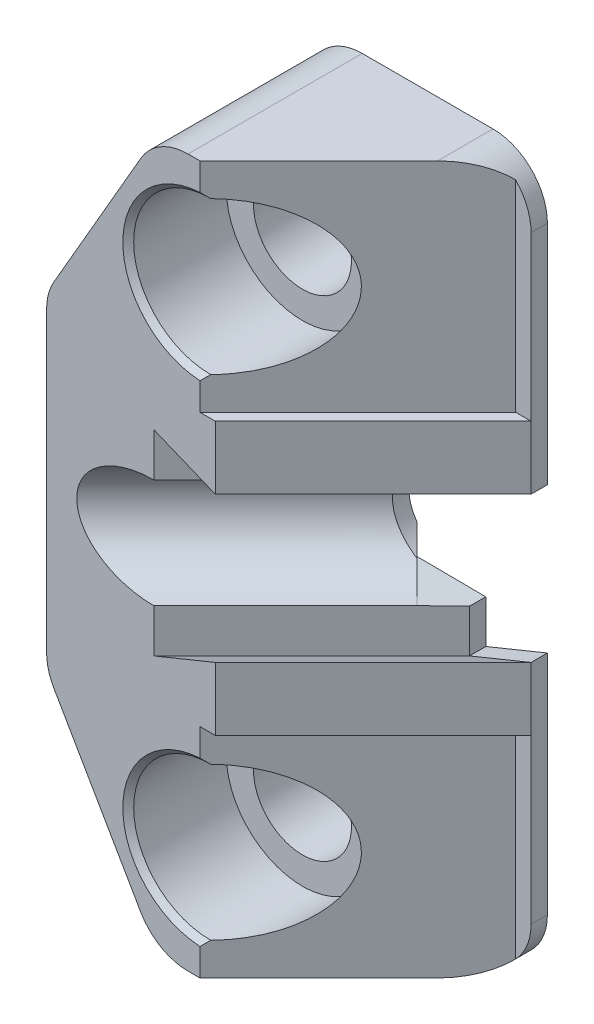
ISO-10303-21;
HEADER;
FILE_DESCRIPTION(('STEP AP214'),'2;1');
FILE_NAME('part.step','',(''),(''),'','','');
FILE_SCHEMA(('AUTOMOTIVE_DESIGN { 1 0 10303 214 1 1 1 1 }'));
ENDSEC;
DATA;
#1=APPLICATION_CONTEXT('core data for automotive mechanical design processes');
#2=APPLICATION_PROTOCOL_DEFINITION('international standard','automotive_design',2000,#1);
#3=PRODUCT_CONTEXT('',#1,'mechanical');
#4=PRODUCT('Part','Part','',(#3));
#5=PRODUCT_RELATED_PRODUCT_CATEGORY('part','',(#4));
#6=PRODUCT_DEFINITION_FORMATION('','',#4);
#7=PRODUCT_DEFINITION_CONTEXT('part definition',#1,'design');
#8=PRODUCT_DEFINITION('design','',#6,#7);
#9=PRODUCT_DEFINITION_SHAPE('','',#8);
#10=(LENGTH_UNIT() NAMED_UNIT(*) SI_UNIT(.MILLI.,.METRE.));
#11=(NAMED_UNIT(*) PLANE_ANGLE_UNIT() SI_UNIT($,.RADIAN.));
#12=(NAMED_UNIT(*) SI_UNIT($,.STERADIAN.) SOLID_ANGLE_UNIT());
#13=UNCERTAINTY_MEASURE_WITH_UNIT(LENGTH_MEASURE(1.E-05),#10,'distance_accuracy_value','');
#14=(GEOMETRIC_REPRESENTATION_CONTEXT(3) GLOBAL_UNCERTAINTY_ASSIGNED_CONTEXT((#13)) GLOBAL_UNIT_ASSIGNED_CONTEXT((#10,
#11,#12)) REPRESENTATION_CONTEXT('',''));
#15=CARTESIAN_POINT('',(0.,0.,0.));
#16=DIRECTION('',(0.,0.,1.));
#17=DIRECTION('',(1.,0.,0.));
#18=AXIS2_PLACEMENT_3D('',#15,#16,#17);
#19=CARTESIAN_POINT('',(15.5,-10.,16.));
#20=DIRECTION('',(0.,1.,0.));
#21=DIRECTION('',(0.,0.,-1.));
#22=AXIS2_PLACEMENT_3D('',#19,#20,#21);
#23=PLANE('',#22);
#24=DIRECTION('',(-1.,0.,0.));
#25=VECTOR('',#24,1.);
#26=CARTESIAN_POINT('',(-22.5,-10.,0.));
#27=LINE('',#26,#25);
#28=CARTESIAN_POINT('',(10.5,-10.,0.));
#29=VERTEX_POINT('',#28);
#30=CARTESIAN_POINT('',(-1.50961894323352,-10.,0.));
#31=VERTEX_POINT('',#30);
#32=EDGE_CURVE('E705',#29,#31,#27,.T.);
#33=ORIENTED_EDGE('',*,*,#32,.F.);
#34=DIRECTION('',(0.,0.,1.));
#35=VECTOR('',#34,1.);
#36=CARTESIAN_POINT('',(10.5,-10.,16.));
#37=LINE('',#36,#35);
#38=CARTESIAN_POINT('',(10.5,-10.,5.08578643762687));
#39=VERTEX_POINT('',#38);
#40=EDGE_CURVE('E422',#29,#39,#37,.T.);
#41=ORIENTED_EDGE('',*,*,#40,.T.);
#42=DIRECTION('',(-0.707106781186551,0.,0.707106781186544));
#43=VECTOR('',#42,1.);
#44=CARTESIAN_POINT('',(14.0857864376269,-10.,1.5));
#45=LINE('',#44,#43);
#46=CARTESIAN_POINT('',(-0.414213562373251,-10.,16.));
#47=VERTEX_POINT('',#46);
#48=EDGE_CURVE('E265',#39,#47,#45,.T.);
#49=ORIENTED_EDGE('',*,*,#48,.T.);
#50=DIRECTION('',(1.,0.,0.));
#51=VECTOR('',#50,1.);
#52=CARTESIAN_POINT('',(15.5,-10.,16.));
#53=LINE('',#52,#51);
#54=CARTESIAN_POINT('',(-1.50961894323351,-10.,16.));
#55=VERTEX_POINT('',#54);
#56=EDGE_CURVE('E600',#55,#47,#53,.T.);
#57=ORIENTED_EDGE('',*,*,#56,.F.);
#58=DIRECTION('',(0.,0.,1.));
#59=VECTOR('',#58,1.);
#60=CARTESIAN_POINT('',(-1.50961894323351,-10.,16.));
#61=LINE('',#60,#59);
#62=EDGE_CURVE('E635',#55,#31,#61,.F.);
#63=ORIENTED_EDGE('',*,*,#62,.T.);
#64=EDGE_LOOP('',(#33,#41,#49,#57,#63));
#65=FACE_BOUND('',#64,.T.);
#66=ADVANCED_FACE('F14',(#65),#23,.F.);
#67=CARTESIAN_POINT('',(15.5,55.,16.));
#68=DIRECTION('',(0.,0.,1.));
#69=DIRECTION('',(-1.,0.,0.));
#70=AXIS2_PLACEMENT_3D('',#67,#68,#69);
#71=PLANE('',#70);
#72=ORIENTED_EDGE('',*,*,#56,.T.);
#73=DIRECTION('',(0.,-1.,0.));
#74=VECTOR('',#73,1.);
#75=CARTESIAN_POINT('',(-0.414213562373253,10.,16.));
#76=LINE('',#75,#74);
#77=CARTESIAN_POINT('',(-0.414213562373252,-7.4885530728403,16.));
#78=VERTEX_POINT('',#77);
#79=EDGE_CURVE('E283',#78,#47,#76,.T.);
#80=ORIENTED_EDGE('',*,*,#79,.F.);
#81=CARTESIAN_POINT('',(0.,0.,16.));
#82=DIRECTION('',(0.,0.,1.));
#83=DIRECTION('',(-1.,0.,0.));
#84=AXIS2_PLACEMENT_3D('',#81,#82,#83);
#85=CIRCLE('',#84,7.5);
#86=CARTESIAN_POINT('',(-0.414213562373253,7.4885530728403,16.));
#87=VERTEX_POINT('',#86);
#88=EDGE_CURVE('E616',#78,#87,#85,.F.);
#89=ORIENTED_EDGE('',*,*,#88,.T.);
#90=CARTESIAN_POINT('',(-0.414213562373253,10.,16.));
#91=VERTEX_POINT('',#90);
#92=EDGE_CURVE('E288',#91,#87,#76,.T.);
#93=ORIENTED_EDGE('',*,*,#92,.F.);
#94=DIRECTION('',(1.,0.,0.));
#95=VECTOR('',#94,1.);
#96=CARTESIAN_POINT('',(0.999999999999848,10.,16.));
#97=LINE('',#96,#95);
#98=CARTESIAN_POINT('',(0.999999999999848,10.,16.));
#99=VERTEX_POINT('',#98);
#100=EDGE_CURVE('E278',#91,#99,#97,.T.);
#101=ORIENTED_EDGE('',*,*,#100,.T.);
#102=DIRECTION('',(0.,1.,0.));
#103=VECTOR('',#102,1.);
#104=CARTESIAN_POINT('',(0.99999999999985,-10.,16.));
#105=LINE('',#104,#103);
#106=CARTESIAN_POINT('',(0.999999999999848,15.8094010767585,16.));
#107=VERTEX_POINT('',#106);
#108=EDGE_CURVE('E592',#99,#107,#105,.T.);
#109=ORIENTED_EDGE('',*,*,#108,.T.);
#110=DIRECTION('',(0.925820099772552,0.377964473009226,0.));
#111=VECTOR('',#110,1.);
#112=CARTESIAN_POINT('',(27.1424242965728,26.4820011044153,16.));
#113=LINE('',#112,#111);
#114=CARTESIAN_POINT('',(-4.65685424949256,13.5,16.));
#115=VERTEX_POINT('',#114);
#116=EDGE_CURVE('E540',#115,#107,#113,.T.);
#117=ORIENTED_EDGE('',*,*,#116,.F.);
#118=DIRECTION('',(0.,-1.,0.));
#119=VECTOR('',#118,1.);
#120=CARTESIAN_POINT('',(-4.65685424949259,55.,16.));
#121=LINE('',#120,#119);
#122=CARTESIAN_POINT('',(-4.65685424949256,17.5,16.));
#123=VERTEX_POINT('',#122);
#124=EDGE_CURVE('E575',#123,#115,#121,.T.);
#125=ORIENTED_EDGE('',*,*,#124,.F.);
#126=CARTESIAN_POINT('',(-4.65685424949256,22.5,16.));
#127=DIRECTION('',(0.,0.,1.));
#128=DIRECTION('',(-1.,0.,0.));
#129=AXIS2_PLACEMENT_3D('',#126,#127,#128);
#130=ELLIPSE('',#129,7.07106781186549,5.);
#131=CARTESIAN_POINT('',(-4.65685424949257,27.5,16.));
#132=VERTEX_POINT('',#131);
#133=EDGE_CURVE('E556',#132,#123,#130,.T.);
#134=ORIENTED_EDGE('',*,*,#133,.F.);
#135=CARTESIAN_POINT('',(-4.65685424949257,31.5,16.));
#136=VERTEX_POINT('',#135);
#137=EDGE_CURVE('E576',#136,#132,#121,.T.);
#138=ORIENTED_EDGE('',*,*,#137,.F.);
#139=DIRECTION('',(-0.925820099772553,0.377964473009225,0.));
#140=VECTOR('',#139,1.);
#141=CARTESIAN_POINT('',(4.39716239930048,27.8037131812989,16.));
#142=LINE('',#141,#140);
#143=CARTESIAN_POINT('',(0.999999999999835,29.1905989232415,16.));
#144=VERTEX_POINT('',#143);
#145=EDGE_CURVE('E539',#144,#136,#142,.T.);
#146=ORIENTED_EDGE('',*,*,#145,.F.);
#147=CARTESIAN_POINT('',(0.999999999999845,35.,16.));
#148=VERTEX_POINT('',#147);
#149=EDGE_CURVE('E591',#144,#148,#105,.T.);
#150=ORIENTED_EDGE('',*,*,#149,.T.);
#151=DIRECTION('',(1.,0.,0.));
#152=VECTOR('',#151,1.);
#153=CARTESIAN_POINT('',(0.999999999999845,35.,16.));
#154=LINE('',#153,#152);
#155=CARTESIAN_POINT('',(-0.414213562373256,35.,16.));
#156=VERTEX_POINT('',#155);
#157=EDGE_CURVE('E299',#156,#148,#154,.T.);
#158=ORIENTED_EDGE('',*,*,#157,.F.);
#159=DIRECTION('',(0.,1.,0.));
#160=VECTOR('',#159,1.);
#161=CARTESIAN_POINT('',(-0.414213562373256,35.,16.));
#162=LINE('',#161,#160);
#163=CARTESIAN_POINT('',(-0.414213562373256,37.5114469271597,16.));
#164=VERTEX_POINT('',#163);
#165=EDGE_CURVE('E309',#156,#164,#162,.T.);
#166=ORIENTED_EDGE('',*,*,#165,.T.);
#167=CARTESIAN_POINT('',(0.,45.,16.));
#168=DIRECTION('',(0.,0.,1.));
#169=DIRECTION('',(-1.,0.,0.));
#170=AXIS2_PLACEMENT_3D('',#167,#168,#169);
#171=CIRCLE('',#170,7.5);
#172=CARTESIAN_POINT('',(-0.414213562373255,52.4885530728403,16.));
#173=VERTEX_POINT('',#172);
#174=EDGE_CURVE('E613',#164,#173,#171,.F.);
#175=ORIENTED_EDGE('',*,*,#174,.T.);
#176=CARTESIAN_POINT('',(-0.414213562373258,55.,16.));
#177=VERTEX_POINT('',#176);
#178=EDGE_CURVE('E312',#173,#177,#162,.T.);
#179=ORIENTED_EDGE('',*,*,#178,.T.);
#180=DIRECTION('',(-1.,0.,0.));
#181=VECTOR('',#180,1.);
#182=CARTESIAN_POINT('',(15.5,55.,16.));
#183=LINE('',#182,#181);
#184=CARTESIAN_POINT('',(-1.50961894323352,55.,16.));
#185=VERTEX_POINT('',#184);
#186=EDGE_CURVE('E597',#177,#185,#183,.T.);
#187=ORIENTED_EDGE('',*,*,#186,.T.);
#188=CARTESIAN_POINT('',(-1.50961894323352,50.,16.));
#189=DIRECTION('',(0.,0.,1.));
#190=DIRECTION('',(-1.,0.,0.));
#191=AXIS2_PLACEMENT_3D('',#188,#189,#190);
#192=CIRCLE('',#191,5.);
#193=CARTESIAN_POINT('',(-5.83974596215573,52.5,16.));
#194=VERTEX_POINT('',#193);
#195=EDGE_CURVE('E629',#185,#194,#192,.T.);
#196=ORIENTED_EDGE('',*,*,#195,.T.);
#197=DIRECTION('',(0.5,0.866025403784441,0.));
#198=VECTOR('',#197,1.);
#199=CARTESIAN_POINT('',(-14.5,37.5,16.));
#200=LINE('',#199,#198);
#201=CARTESIAN_POINT('',(-13.8301270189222,38.6602540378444,16.));
#202=VERTEX_POINT('',#201);
#203=EDGE_CURVE('E317',#202,#194,#200,.T.);
#204=ORIENTED_EDGE('',*,*,#203,.F.);
#205=CARTESIAN_POINT('',(-9.5,36.1602540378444,16.));
#206=DIRECTION('',(0.,0.,1.));
#207=DIRECTION('',(-1.,0.,0.));
#208=AXIS2_PLACEMENT_3D('',#205,#206,#207);
#209=CIRCLE('',#208,5.);
#210=CARTESIAN_POINT('',(-14.5,36.1602540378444,16.));
#211=VERTEX_POINT('',#210);
#212=EDGE_CURVE('E627',#202,#211,#209,.T.);
#213=ORIENTED_EDGE('',*,*,#212,.T.);
#214=DIRECTION('',(0.,1.,0.));
#215=VECTOR('',#214,1.);
#216=CARTESIAN_POINT('',(-14.5,-10.,16.));
#217=LINE('',#216,#215);
#218=CARTESIAN_POINT('',(-14.5,8.8397459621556,16.));
#219=VERTEX_POINT('',#218);
#220=EDGE_CURVE('E329',#219,#211,#217,.T.);
#221=ORIENTED_EDGE('',*,*,#220,.F.);
#222=CARTESIAN_POINT('',(-9.5,8.8397459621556,16.));
#223=DIRECTION('',(0.,0.,1.));
#224=DIRECTION('',(-1.,0.,0.));
#225=AXIS2_PLACEMENT_3D('',#222,#223,#224);
#226=CIRCLE('',#225,5.);
#227=CARTESIAN_POINT('',(-13.8301270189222,6.33974596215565,16.));
#228=VERTEX_POINT('',#227);
#229=EDGE_CURVE('E631',#219,#228,#226,.T.);
#230=ORIENTED_EDGE('',*,*,#229,.T.);
#231=DIRECTION('',(-0.5,0.866025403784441,0.));
#232=VECTOR('',#231,1.);
#233=CARTESIAN_POINT('',(-14.5,7.5,16.));
#234=LINE('',#233,#232);
#235=CARTESIAN_POINT('',(-5.83974596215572,-7.5,16.));
#236=VERTEX_POINT('',#235);
#237=EDGE_CURVE('E323',#236,#228,#234,.T.);
#238=ORIENTED_EDGE('',*,*,#237,.F.);
#239=CARTESIAN_POINT('',(-1.50961894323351,-5.,16.));
#240=DIRECTION('',(0.,0.,1.));
#241=DIRECTION('',(-1.,0.,0.));
#242=AXIS2_PLACEMENT_3D('',#239,#240,#241);
#243=CIRCLE('',#242,5.);
#244=EDGE_CURVE('E633',#236,#55,#243,.T.);
#245=ORIENTED_EDGE('',*,*,#244,.T.);
#246=EDGE_LOOP('',(#72,#80,#89,#93,#101,#109,#117,#125,#134,#138,#146,#150,#158,#166,#175,#179,
#187,#196,#204,#213,#221,#230,#238,#245));
#247=FACE_BOUND('',#246,.T.);
#248=ADVANCED_FACE('F466',(#247),#71,.T.);
#249=CARTESIAN_POINT('',(15.5,-10.,1.5));
#250=DIRECTION('',(-0.707106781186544,0.,-0.707106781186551));
#251=DIRECTION('',(0.707106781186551,0.,-0.707106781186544));
#252=AXIS2_PLACEMENT_3D('',#249,#250,#251);
#253=PLANE('',#252);
#254=DIRECTION('',(0.707106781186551,0.,-0.707106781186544));
#255=VECTOR('',#254,1.);
#256=CARTESIAN_POINT('',(15.5,10.,1.5));
#257=LINE('',#256,#255);
#258=CARTESIAN_POINT('',(15.5,10.,1.5));
#259=VERTEX_POINT('',#258);
#260=EDGE_CURVE('E275',#99,#259,#257,.T.);
#261=ORIENTED_EDGE('',*,*,#260,.T.);
#262=DIRECTION('',(0.,1.,0.));
#263=VECTOR('',#262,1.);
#264=CARTESIAN_POINT('',(15.5,-10.,1.5));
#265=LINE('',#264,#263);
#266=CARTESIAN_POINT('',(15.5,15.8094010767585,1.49999999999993));
#267=VERTEX_POINT('',#266);
#268=EDGE_CURVE('E598',#259,#267,#265,.T.);
#269=ORIENTED_EDGE('',*,*,#268,.T.);
#270=DIRECTION('',(-0.707106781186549,0.,0.707106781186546));
#271=VECTOR('',#270,1.);
#272=CARTESIAN_POINT('',(15.5,15.8094010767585,1.49999999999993));
#273=LINE('',#272,#271);
#274=EDGE_CURVE('E563',#267,#107,#273,.T.);
#275=ORIENTED_EDGE('',*,*,#274,.T.);
#276=ORIENTED_EDGE('',*,*,#108,.F.);
#277=EDGE_LOOP('',(#261,#269,#275,#276));
#278=FACE_BOUND('',#277,.T.);
#279=ADVANCED_FACE('F472',(#278),#253,.F.);
#280=CARTESIAN_POINT('',(0.,0.,16.));
#281=DIRECTION('',(0.,0.,1.));
#282=DIRECTION('',(-1.,0.,0.));
#283=AXIS2_PLACEMENT_3D('',#280,#281,#282);
#284=CYLINDRICAL_SURFACE('',#283,7.);
#285=CARTESIAN_POINT('',(0.,0.,7.));
#286=DIRECTION('',(0.,0.,1.));
#287=DIRECTION('',(-1.,0.,0.));
#288=AXIS2_PLACEMENT_3D('',#285,#286,#287);
#289=CIRCLE('',#288,7.);
#290=CARTESIAN_POINT('',(-7.,0.,7.));
#291=VERTEX_POINT('',#290);
#292=EDGE_CURVE('E579',#291,#291,#289,.T.);
#293=ORIENTED_EDGE('',*,*,#292,.F.);
#294=EDGE_LOOP('',(#293));
#295=FACE_BOUND('',#294,.T.);
#296=CARTESIAN_POINT('',(0.,0.,15.5857864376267));
#297=DIRECTION('',(0.707106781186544,0.,0.707106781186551));
#298=DIRECTION('',(-0.707106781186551,0.,0.707106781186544));
#299=AXIS2_PLACEMENT_3D('',#296,#297,#298);
#300=ELLIPSE('',#299,9.89949493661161,7.);
#301=CARTESIAN_POINT('',(0.0857864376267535,6.99947431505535,15.5));
#302=VERTEX_POINT('',#301);
#303=CARTESIAN_POINT('',(0.0857864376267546,-6.99947431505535,15.5));
#304=VERTEX_POINT('',#303);
#305=EDGE_CURVE('E287',#302,#304,#300,.F.);
#306=ORIENTED_EDGE('',*,*,#305,.F.);
#307=CARTESIAN_POINT('',(0.,0.,15.5));
#308=DIRECTION('',(0.,0.,1.));
#309=DIRECTION('',(-1.,0.,0.));
#310=AXIS2_PLACEMENT_3D('',#307,#308,#309);
#311=CIRCLE('',#310,7.);
#312=EDGE_CURVE('E610',#302,#304,#311,.T.);
#313=ORIENTED_EDGE('',*,*,#312,.T.);
#314=EDGE_LOOP('',(#306,#313));
#315=FACE_BOUND('',#314,.T.);
#316=ADVANCED_FACE('F430',(#295,#315),#284,.F.);
#317=CARTESIAN_POINT('',(0.,0.,15.5));
#318=DIRECTION('',(0.,0.,1.));
#319=DIRECTION('',(-1.,0.,0.));
#320=AXIS2_PLACEMENT_3D('',#317,#318,#319);
#321=CONICAL_SURFACE('',#320,7.,0.78539816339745);
#322=ORIENTED_EDGE('',*,*,#312,.F.);
#323=CARTESIAN_POINT('',(0.0859864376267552,6.99927184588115,15.4998));
#324=CARTESIAN_POINT('',(0.0447551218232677,7.04101258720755,15.5410313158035));
#325=CARTESIAN_POINT('',(0.00339908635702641,7.08250663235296,15.5823873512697));
#326=CARTESIAN_POINT('',(-0.0795489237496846,7.16501257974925,15.6653353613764));
#327=CARTESIAN_POINT('',(-0.121140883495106,7.20602451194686,15.7069273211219));
#328=CARTESIAN_POINT('',(-0.204552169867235,7.28758247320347,15.790338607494));
#329=CARTESIAN_POINT('',(-0.246371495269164,7.32812850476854,15.8321579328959));
#330=CARTESIAN_POINT('',(-0.330230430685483,7.40877042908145,15.9160168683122));
#331=CARTESIAN_POINT('',(-0.372270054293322,7.44886629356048,15.9580564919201));
#332=CARTESIAN_POINT('',(-0.414413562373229,7.4887423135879,16.0002));
#333=B_SPLINE_CURVE_WITH_KNOTS('',3,(#323,#324,#325,#326,#327,#328,#329,#330,#331,#332),
.UNSPECIFIED.,.F.,.F.,(4,2,2,2,4),(0.,0.215129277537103,0.430245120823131,0.645359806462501,
0.86048792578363),.UNSPECIFIED.);
#334=EDGE_CURVE('E415',#302,#87,#333,.T.);
#335=ORIENTED_EDGE('',*,*,#334,.T.);
#336=ORIENTED_EDGE('',*,*,#88,.F.);
#337=CARTESIAN_POINT('',(-0.414413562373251,-7.48874231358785,16.0002));
#338=CARTESIAN_POINT('',(-0.372270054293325,-7.44886629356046,15.9580564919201));
#339=CARTESIAN_POINT('',(-0.330230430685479,-7.40877042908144,15.9160168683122));
#340=CARTESIAN_POINT('',(-0.246371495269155,-7.32812850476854,15.8321579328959));
#341=CARTESIAN_POINT('',(-0.20455216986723,-7.28758247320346,15.790338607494));
#342=CARTESIAN_POINT('',(-0.121140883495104,-7.20602451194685,15.7069273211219));
#343=CARTESIAN_POINT('',(-0.0795489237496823,-7.16501257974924,15.6653353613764));
#344=CARTESIAN_POINT('',(0.00339908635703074,-7.08250663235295,15.5823873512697));
#345=CARTESIAN_POINT('',(0.0447551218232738,-7.04101258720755,15.5410313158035));
#346=CARTESIAN_POINT('',(0.0859864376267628,-6.99927184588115,15.4998));
#347=B_SPLINE_CURVE_WITH_KNOTS('',3,(#337,#338,#339,#340,#341,#342,#343,#344,#345,#346),
.UNSPECIFIED.,.F.,.F.,(4,2,2,2,4),(0.,0.215128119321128,0.430242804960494,0.645358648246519,
0.86048792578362),.UNSPECIFIED.);
#348=EDGE_CURVE('E407',#78,#304,#347,.T.);
#349=ORIENTED_EDGE('',*,*,#348,.T.);
#350=EDGE_LOOP('',(#322,#335,#336,#349));
#351=FACE_BOUND('',#350,.T.);
#352=ADVANCED_FACE('F424',(#351),#321,.F.);
#353=DIRECTION('',(0.707106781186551,0.,-0.707106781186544));
#354=VECTOR('',#353,1.);
#355=CARTESIAN_POINT('',(15.5,35.,1.5));
#356=LINE('',#355,#354);
#357=CARTESIAN_POINT('',(15.5,35.,1.5));
#358=VERTEX_POINT('',#357);
#359=EDGE_CURVE('E301',#148,#358,#356,.T.);
#360=ORIENTED_EDGE('',*,*,#359,.F.);
#361=ORIENTED_EDGE('',*,*,#149,.F.);
#362=DIRECTION('',(-0.707106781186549,0.,0.707106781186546));
#363=VECTOR('',#362,1.);
#364=CARTESIAN_POINT('',(15.5,29.1905989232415,1.49999999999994));
#365=LINE('',#364,#363);
#366=CARTESIAN_POINT('',(15.5,29.1905989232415,1.49999999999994));
#367=VERTEX_POINT('',#366);
#368=EDGE_CURVE('E560',#367,#144,#365,.T.);
#369=ORIENTED_EDGE('',*,*,#368,.F.);
#370=EDGE_CURVE('E594',#367,#358,#265,.T.);
#371=ORIENTED_EDGE('',*,*,#370,.T.);
#372=EDGE_LOOP('',(#360,#361,#369,#371));
#373=FACE_BOUND('',#372,.T.);
#374=ADVANCED_FACE('F429',(#373),#253,.F.);
#375=CARTESIAN_POINT('',(12.6715728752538,13.5,-1.32842712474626));
#376=DIRECTION('',(-0.707106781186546,0.,-0.707106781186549));
#377=DIRECTION('',(0.707106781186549,0.,-0.707106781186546));
#378=AXIS2_PLACEMENT_3D('',#375,#376,#377);
#379=PLANE('',#378);
#380=DIRECTION('',(0.,-1.,0.));
#381=VECTOR('',#380,1.);
#382=CARTESIAN_POINT('',(9.84314575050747,55.,1.5));
#383=LINE('',#382,#381);
#384=CARTESIAN_POINT('',(9.8431457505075,17.4604018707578,1.5));
#385=VERTEX_POINT('',#384);
#386=CARTESIAN_POINT('',(9.8431457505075,13.5,1.5));
#387=VERTEX_POINT('',#386);
#388=EDGE_CURVE('E603',#385,#387,#383,.T.);
#389=ORIENTED_EDGE('',*,*,#388,.F.);
#390=DIRECTION('',(-0.707059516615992,0.0115620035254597,0.70705951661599));
#391=VECTOR('',#390,1.);
#392=CARTESIAN_POINT('',(12.7035711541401,17.4136275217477,-1.36042540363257));
#393=LINE('',#392,#391);
#394=CARTESIAN_POINT('',(7.42157287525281,17.5,3.92157287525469));
#395=VERTEX_POINT('',#394);
#396=EDGE_CURVE('E37',#385,#395,#393,.T.);
#397=ORIENTED_EDGE('',*,*,#396,.T.);
#398=DIRECTION('',(-0.707106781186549,0.,0.707106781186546));
#399=VECTOR('',#398,1.);
#400=CARTESIAN_POINT('',(12.6715728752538,17.5,-1.3284271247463));
#401=LINE('',#400,#399);
#402=EDGE_CURVE('E608',#395,#123,#401,.T.);
#403=ORIENTED_EDGE('',*,*,#402,.T.);
#404=ORIENTED_EDGE('',*,*,#124,.T.);
#405=DIRECTION('',(-0.707106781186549,0.,0.707106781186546));
#406=VECTOR('',#405,1.);
#407=CARTESIAN_POINT('',(12.6715728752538,13.5,-1.32842712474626));
#408=LINE('',#407,#406);
#409=EDGE_CURVE('E566',#387,#115,#408,.T.);
#410=ORIENTED_EDGE('',*,*,#409,.F.);
#411=EDGE_LOOP('',(#389,#397,#403,#404,#410));
#412=FACE_BOUND('',#411,.T.);
#413=ADVANCED_FACE('F512',(#412),#379,.F.);
#414=CARTESIAN_POINT('',(15.5,55.,16.));
#415=DIRECTION('',(0.,-1.,0.));
#416=DIRECTION('',(0.,0.,1.));
#417=AXIS2_PLACEMENT_3D('',#414,#415,#416);
#418=PLANE('',#417);
#419=DIRECTION('',(-0.707106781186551,0.,0.707106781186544));
#420=VECTOR('',#419,1.);
#421=CARTESIAN_POINT('',(14.0857864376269,55.,1.5));
#422=LINE('',#421,#420);
#423=CARTESIAN_POINT('',(10.5,55.,5.08578643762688));
#424=VERTEX_POINT('',#423);
#425=EDGE_CURVE('E291',#424,#177,#422,.T.);
#426=ORIENTED_EDGE('',*,*,#425,.F.);
#427=DIRECTION('',(0.,0.,1.));
#428=VECTOR('',#427,1.);
#429=CARTESIAN_POINT('',(10.5,55.,16.));
#430=LINE('',#429,#428);
#431=CARTESIAN_POINT('',(10.5,55.,0.));
#432=VERTEX_POINT('',#431);
#433=EDGE_CURVE('E726',#424,#432,#430,.F.);
#434=ORIENTED_EDGE('',*,*,#433,.T.);
#435=DIRECTION('',(1.,0.,0.));
#436=VECTOR('',#435,1.);
#437=CARTESIAN_POINT('',(15.5,55.,0.));
#438=LINE('',#437,#436);
#439=CARTESIAN_POINT('',(-1.50961894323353,55.,0.));
#440=VERTEX_POINT('',#439);
#441=EDGE_CURVE('E341',#440,#432,#438,.T.);
#442=ORIENTED_EDGE('',*,*,#441,.F.);
#443=DIRECTION('',(0.,0.,1.));
#444=VECTOR('',#443,1.);
#445=CARTESIAN_POINT('',(-1.50961894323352,55.,16.));
#446=LINE('',#445,#444);
#447=EDGE_CURVE('E651',#440,#185,#446,.T.);
#448=ORIENTED_EDGE('',*,*,#447,.T.);
#449=ORIENTED_EDGE('',*,*,#186,.F.);
#450=EDGE_LOOP('',(#426,#434,#442,#448,#449));
#451=FACE_BOUND('',#450,.T.);
#452=ADVANCED_FACE('F16',(#451),#418,.F.);
#453=CARTESIAN_POINT('',(0.,45.,16.));
#454=DIRECTION('',(0.,0.,1.));
#455=DIRECTION('',(-1.,0.,0.));
#456=AXIS2_PLACEMENT_3D('',#453,#454,#455);
#457=CYLINDRICAL_SURFACE('',#456,7.);
#458=CARTESIAN_POINT('',(0.,45.,7.));
#459=DIRECTION('',(0.,0.,1.));
#460=DIRECTION('',(-1.,0.,0.));
#461=AXIS2_PLACEMENT_3D('',#458,#459,#460);
#462=CIRCLE('',#461,7.);
#463=CARTESIAN_POINT('',(-7.00000000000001,45.,7.));
#464=VERTEX_POINT('',#463);
#465=EDGE_CURVE('E585',#464,#464,#462,.T.);
#466=ORIENTED_EDGE('',*,*,#465,.F.);
#467=EDGE_LOOP('',(#466));
#468=FACE_BOUND('',#467,.T.);
#469=CARTESIAN_POINT('',(0.,45.,15.5));
#470=DIRECTION('',(0.,0.,1.));
#471=DIRECTION('',(-1.,0.,0.));
#472=AXIS2_PLACEMENT_3D('',#469,#470,#471);
#473=CIRCLE('',#472,7.);
#474=CARTESIAN_POINT('',(0.0857864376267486,51.9994743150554,15.5));
#475=VERTEX_POINT('',#474);
#476=CARTESIAN_POINT('',(0.0857864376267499,38.0005256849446,15.5));
#477=VERTEX_POINT('',#476);
#478=EDGE_CURVE('E619',#475,#477,#473,.T.);
#479=ORIENTED_EDGE('',*,*,#478,.T.);
#480=CARTESIAN_POINT('',(0.,45.,15.5857864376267));
#481=DIRECTION('',(-0.707106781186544,0.,-0.707106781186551));
#482=DIRECTION('',(-0.707106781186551,0.,0.707106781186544));
#483=AXIS2_PLACEMENT_3D('',#480,#481,#482);
#484=ELLIPSE('',#483,9.89949493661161,7.);
#485=EDGE_CURVE('E308',#477,#475,#484,.F.);
#486=ORIENTED_EDGE('',*,*,#485,.T.);
#487=EDGE_LOOP('',(#479,#486));
#488=FACE_BOUND('',#487,.T.);
#489=ADVANCED_FACE('F484',(#468,#488),#457,.F.);
#490=CARTESIAN_POINT('',(0.,45.,16.));
#491=DIRECTION('',(0.,0.,1.));
#492=DIRECTION('',(-1.,0.,0.));
#493=AXIS2_PLACEMENT_3D('',#490,#491,#492);
#494=CYLINDRICAL_SURFACE('',#493,4.5);
#495=CARTESIAN_POINT('',(0.,45.,7.));
#496=DIRECTION('',(0.,0.,1.));
#497=DIRECTION('',(-1.,0.,0.));
#498=AXIS2_PLACEMENT_3D('',#495,#496,#497);
#499=CIRCLE('',#498,4.5);
#500=CARTESIAN_POINT('',(-4.50000000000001,45.,7.));
#501=VERTEX_POINT('',#500);
#502=EDGE_CURVE('E588',#501,#501,#499,.T.);
#503=ORIENTED_EDGE('',*,*,#502,.T.);
#504=EDGE_LOOP('',(#503));
#505=FACE_BOUND('',#504,.T.);
#506=CARTESIAN_POINT('',(0.,45.,0.));
#507=DIRECTION('',(0.,0.,-1.));
#508=DIRECTION('',(1.,0.,0.));
#509=AXIS2_PLACEMENT_3D('',#506,#507,#508);
#510=CIRCLE('',#509,4.5);
#511=CARTESIAN_POINT('',(4.49999999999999,45.,0.));
#512=VERTEX_POINT('',#511);
#513=EDGE_CURVE('E335',#512,#512,#510,.T.);
#514=ORIENTED_EDGE('',*,*,#513,.T.);
#515=EDGE_LOOP('',(#514));
#516=FACE_BOUND('',#515,.T.);
#517=ADVANCED_FACE('F480',(#505,#516),#494,.F.);
#518=CARTESIAN_POINT('',(-4.5,45.,7.));
#519=DIRECTION('',(0.,0.,-1.));
#520=DIRECTION('',(1.,0.,0.));
#521=AXIS2_PLACEMENT_3D('',#518,#519,#520);
#522=PLANE('',#521);
#523=ORIENTED_EDGE('',*,*,#502,.F.);
#524=EDGE_LOOP('',(#523));
#525=FACE_BOUND('',#524,.T.);
#526=ORIENTED_EDGE('',*,*,#465,.T.);
#527=EDGE_LOOP('',(#526));
#528=FACE_BOUND('',#527,.T.);
#529=ADVANCED_FACE('F483',(#525,#528),#522,.F.);
#530=CARTESIAN_POINT('',(0.,0.,16.));
#531=DIRECTION('',(0.,0.,1.));
#532=DIRECTION('',(-1.,0.,0.));
#533=AXIS2_PLACEMENT_3D('',#530,#531,#532);
#534=CYLINDRICAL_SURFACE('',#533,4.5);
#535=CARTESIAN_POINT('',(0.,0.,7.));
#536=DIRECTION('',(0.,0.,1.));
#537=DIRECTION('',(-1.,0.,0.));
#538=AXIS2_PLACEMENT_3D('',#535,#536,#537);
#539=CIRCLE('',#538,4.5);
#540=CARTESIAN_POINT('',(-4.5,0.,7.));
#541=VERTEX_POINT('',#540);
#542=EDGE_CURVE('E582',#541,#541,#539,.T.);
#543=ORIENTED_EDGE('',*,*,#542,.T.);
#544=EDGE_LOOP('',(#543));
#545=FACE_BOUND('',#544,.T.);
#546=CARTESIAN_POINT('',(0.,0.,0.));
#547=DIRECTION('',(0.,0.,-1.));
#548=DIRECTION('',(1.,0.,0.));
#549=AXIS2_PLACEMENT_3D('',#546,#547,#548);
#550=CIRCLE('',#549,4.5);
#551=CARTESIAN_POINT('',(4.5,0.,0.));
#552=VERTEX_POINT('',#551);
#553=EDGE_CURVE('E338',#552,#552,#550,.T.);
#554=ORIENTED_EDGE('',*,*,#553,.T.);
#555=EDGE_LOOP('',(#554));
#556=FACE_BOUND('',#555,.T.);
#557=ADVANCED_FACE('F488',(#545,#556),#534,.F.);
#558=CARTESIAN_POINT('',(-4.5,0.,7.));
#559=DIRECTION('',(0.,0.,-1.));
#560=DIRECTION('',(1.,0.,0.));
#561=AXIS2_PLACEMENT_3D('',#558,#559,#560);
#562=PLANE('',#561);
#563=ORIENTED_EDGE('',*,*,#542,.F.);
#564=EDGE_LOOP('',(#563));
#565=FACE_BOUND('',#564,.T.);
#566=ORIENTED_EDGE('',*,*,#292,.T.);
#567=EDGE_LOOP('',(#566));
#568=FACE_BOUND('',#567,.T.);
#569=ADVANCED_FACE('F495',(#565,#568),#562,.F.);
#570=DIRECTION('',(-0.707106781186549,0.,0.707106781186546));
#571=VECTOR('',#570,1.);
#572=CARTESIAN_POINT('',(12.6715728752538,27.5,-1.3284271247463));
#573=LINE('',#572,#571);
#574=CARTESIAN_POINT('',(7.42157287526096,27.5,3.92157287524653));
#575=VERTEX_POINT('',#574);
#576=EDGE_CURVE('E605',#132,#575,#573,.F.);
#577=ORIENTED_EDGE('',*,*,#576,.T.);
#578=DIRECTION('',(0.707059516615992,0.011562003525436,-0.70705951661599));
#579=VECTOR('',#578,1.);
#580=CARTESIAN_POINT('',(12.5564207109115,27.5839662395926,-1.21327496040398));
#581=LINE('',#580,#579);
#582=CARTESIAN_POINT('',(9.84314575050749,27.5395981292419,1.5));
#583=VERTEX_POINT('',#582);
#584=EDGE_CURVE('E247',#575,#583,#581,.T.);
#585=ORIENTED_EDGE('',*,*,#584,.T.);
#586=CARTESIAN_POINT('',(9.84314575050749,31.5,1.5));
#587=VERTEX_POINT('',#586);
#588=EDGE_CURVE('E544',#587,#583,#383,.T.);
#589=ORIENTED_EDGE('',*,*,#588,.F.);
#590=DIRECTION('',(-0.707106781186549,0.,0.707106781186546));
#591=VECTOR('',#590,1.);
#592=CARTESIAN_POINT('',(12.6715728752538,31.5,-1.32842712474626));
#593=LINE('',#592,#591);
#594=EDGE_CURVE('E559',#587,#136,#593,.T.);
#595=ORIENTED_EDGE('',*,*,#594,.T.);
#596=ORIENTED_EDGE('',*,*,#137,.T.);
#597=EDGE_LOOP('',(#577,#585,#589,#595,#596));
#598=FACE_BOUND('',#597,.T.);
#599=ADVANCED_FACE('F499',(#598),#379,.F.);
#600=CARTESIAN_POINT('',(12.6715728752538,31.5,-1.32842712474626));
#601=DIRECTION('',(0.353553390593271,0.86602540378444,0.353553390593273));
#602=DIRECTION('',(0.,0.377964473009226,-0.925820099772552));
#603=AXIS2_PLACEMENT_3D('',#600,#601,#602);
#604=PLANE('',#603);
#605=ORIENTED_EDGE('',*,*,#145,.T.);
#606=ORIENTED_EDGE('',*,*,#594,.F.);
#607=DIRECTION('',(-0.925820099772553,0.377964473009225,0.));
#608=VECTOR('',#607,1.);
#609=CARTESIAN_POINT('',(6.46859097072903,32.8776562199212,1.5));
#610=LINE('',#609,#608);
#611=EDGE_CURVE('E532',#367,#587,#610,.T.);
#612=ORIENTED_EDGE('',*,*,#611,.F.);
#613=ORIENTED_EDGE('',*,*,#368,.T.);
#614=EDGE_LOOP('',(#605,#606,#612,#613));
#615=FACE_BOUND('',#614,.T.);
#616=ADVANCED_FACE('F504',(#615),#604,.F.);
#617=CARTESIAN_POINT('',(12.6715728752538,13.5,-1.32842712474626));
#618=DIRECTION('',(0.353553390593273,-0.86602540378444,0.353553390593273));
#619=DIRECTION('',(0.,0.377964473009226,0.925820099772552));
#620=AXIS2_PLACEMENT_3D('',#617,#618,#619);
#621=PLANE('',#620);
#622=ORIENTED_EDGE('',*,*,#116,.T.);
#623=ORIENTED_EDGE('',*,*,#274,.F.);
#624=DIRECTION('',(0.925820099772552,0.377964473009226,0.));
#625=VECTOR('',#624,1.);
#626=CARTESIAN_POINT('',(29.2138528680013,21.408058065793,1.5));
#627=LINE('',#626,#625);
#628=EDGE_CURVE('E562',#387,#267,#627,.T.);
#629=ORIENTED_EDGE('',*,*,#628,.F.);
#630=ORIENTED_EDGE('',*,*,#409,.T.);
#631=EDGE_LOOP('',(#622,#623,#629,#630));
#632=FACE_BOUND('',#631,.T.);
#633=ADVANCED_FACE('F507',(#632),#621,.F.);
#634=CARTESIAN_POINT('',(12.6715728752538,22.5,-1.3284271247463));
#635=DIRECTION('',(-0.707106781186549,0.,0.707106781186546));
#636=DIRECTION('',(-0.707106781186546,0.,-0.707106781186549));
#637=AXIS2_PLACEMENT_3D('',#634,#635,#636);
#638=CYLINDRICAL_SURFACE('',#637,5.);
#639=CARTESIAN_POINT('',(9.84314575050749,22.5,1.5));
#640=DIRECTION('',(0.,0.,1.));
#641=DIRECTION('',(-1.,0.,0.));
#642=AXIS2_PLACEMENT_3D('',#639,#640,#641);
#643=ELLIPSE('',#642,7.07106781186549,5.);
#644=CARTESIAN_POINT('',(5.00000000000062,26.1430714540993,1.5));
#645=VERTEX_POINT('',#644);
#646=CARTESIAN_POINT('',(5.0000000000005,18.8569285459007,1.5));
#647=VERTEX_POINT('',#646);
#648=EDGE_CURVE('E547',#645,#647,#643,.T.);
#649=ORIENTED_EDGE('',*,*,#648,.F.);
#650=CARTESIAN_POINT('',(7.42157287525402,22.5,3.92157287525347));
#651=DIRECTION('',(-0.707106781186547,0.,0.707106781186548));
#652=DIRECTION('',(-0.707106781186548,0.,-0.707106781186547));
#653=AXIS2_PLACEMENT_3D('',#650,#651,#652);
#654=CIRCLE('',#653,5.);
#655=EDGE_CURVE('E29',#645,#575,#654,.F.);
#656=ORIENTED_EDGE('',*,*,#655,.T.);
#657=ORIENTED_EDGE('',*,*,#576,.F.);
#658=ORIENTED_EDGE('',*,*,#133,.T.);
#659=ORIENTED_EDGE('',*,*,#402,.F.);
#660=EDGE_CURVE('E267',#395,#647,#654,.F.);
#661=ORIENTED_EDGE('',*,*,#660,.T.);
#662=EDGE_LOOP('',(#649,#656,#657,#658,#659,#661));
#663=FACE_BOUND('',#662,.T.);
#664=ADVANCED_FACE('F452',(#663),#638,.F.);
#665=CARTESIAN_POINT('',(9.84314575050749,22.5,0.));
#666=DIRECTION('',(0.,0.,-1.));
#667=DIRECTION('',(1.,0.,0.));
#668=AXIS2_PLACEMENT_3D('',#665,#666,#667);
#669=PLANE('',#668);
#670=DIRECTION('',(-0.999966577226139,0.00817584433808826,0.));
#671=VECTOR('',#670,1.);
#672=CARTESIAN_POINT('',(9.80184389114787,17.4484753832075,0.));
#673=LINE('',#672,#671);
#674=CARTESIAN_POINT('',(9.8431457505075,17.4481376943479,0.));
#675=VERTEX_POINT('',#674);
#676=CARTESIAN_POINT('',(3.50000000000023,17.5,-2.37006594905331E-13));
#677=VERTEX_POINT('',#676);
#678=EDGE_CURVE('E792',#675,#677,#673,.T.);
#679=ORIENTED_EDGE('',*,*,#678,.F.);
#680=DIRECTION('',(0.,-1.,0.));
#681=VECTOR('',#680,1.);
#682=CARTESIAN_POINT('',(9.8431457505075,17.5,0.));
#683=LINE('',#682,#681);
#684=CARTESIAN_POINT('',(9.8431457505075,13.5,0.));
#685=VERTEX_POINT('',#684);
#686=EDGE_CURVE('E352',#675,#685,#683,.T.);
#687=ORIENTED_EDGE('',*,*,#686,.T.);
#688=DIRECTION('',(0.925820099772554,0.377964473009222,0.));
#689=VECTOR('',#688,1.);
#690=CARTESIAN_POINT('',(9.8431457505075,13.5,0.));
#691=LINE('',#690,#689);
#692=CARTESIAN_POINT('',(15.5,15.8094010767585,0.));
#693=VERTEX_POINT('',#692);
#694=EDGE_CURVE('E789',#685,#693,#691,.T.);
#695=ORIENTED_EDGE('',*,*,#694,.T.);
#696=DIRECTION('',(0.,-1.,0.));
#697=VECTOR('',#696,1.);
#698=CARTESIAN_POINT('',(15.5,-10.,0.));
#699=LINE('',#698,#697);
#700=CARTESIAN_POINT('',(15.5,-5.,0.));
#701=VERTEX_POINT('',#700);
#702=EDGE_CURVE('E786',#693,#701,#699,.T.);
#703=ORIENTED_EDGE('',*,*,#702,.T.);
#704=CARTESIAN_POINT('',(10.5,-5.,0.));
#705=DIRECTION('',(0.,0.,-1.));
#706=DIRECTION('',(1.,0.,0.));
#707=AXIS2_PLACEMENT_3D('',#704,#705,#706);
#708=CIRCLE('',#707,5.);
#709=EDGE_CURVE('E738',#701,#29,#708,.T.);
#710=ORIENTED_EDGE('',*,*,#709,.T.);
#711=ORIENTED_EDGE('',*,*,#32,.T.);
#712=CARTESIAN_POINT('',(-1.50961894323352,-5.,0.));
#713=DIRECTION('',(0.,0.,-1.));
#714=DIRECTION('',(1.,0.,0.));
#715=AXIS2_PLACEMENT_3D('',#712,#713,#714);
#716=CIRCLE('',#715,5.);
#717=CARTESIAN_POINT('',(-5.83974596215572,-7.5,0.));
#718=VERTEX_POINT('',#717);
#719=EDGE_CURVE('E644',#31,#718,#716,.T.);
#720=ORIENTED_EDGE('',*,*,#719,.T.);
#721=DIRECTION('',(-0.5,0.866025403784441,0.));
#722=VECTOR('',#721,1.);
#723=CARTESIAN_POINT('',(-14.5,7.5,0.));
#724=LINE('',#723,#722);
#725=CARTESIAN_POINT('',(-13.8301270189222,6.33974596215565,0.));
#726=VERTEX_POINT('',#725);
#727=EDGE_CURVE('E326',#718,#726,#724,.T.);
#728=ORIENTED_EDGE('',*,*,#727,.T.);
#729=CARTESIAN_POINT('',(-9.5,8.8397459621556,0.));
#730=DIRECTION('',(0.,0.,-1.));
#731=DIRECTION('',(1.,0.,0.));
#732=AXIS2_PLACEMENT_3D('',#729,#730,#731);
#733=CIRCLE('',#732,5.);
#734=CARTESIAN_POINT('',(-14.5,8.8397459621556,0.));
#735=VERTEX_POINT('',#734);
#736=EDGE_CURVE('E642',#726,#735,#733,.T.);
#737=ORIENTED_EDGE('',*,*,#736,.T.);
#738=DIRECTION('',(0.,1.,0.));
#739=VECTOR('',#738,1.);
#740=CARTESIAN_POINT('',(-14.5,-10.,0.));
#741=LINE('',#740,#739);
#742=CARTESIAN_POINT('',(-14.5,36.1602540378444,0.));
#743=VERTEX_POINT('',#742);
#744=EDGE_CURVE('E332',#735,#743,#741,.T.);
#745=ORIENTED_EDGE('',*,*,#744,.T.);
#746=CARTESIAN_POINT('',(-9.5,36.1602540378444,0.));
#747=DIRECTION('',(0.,0.,-1.));
#748=DIRECTION('',(1.,0.,0.));
#749=AXIS2_PLACEMENT_3D('',#746,#747,#748);
#750=CIRCLE('',#749,5.);
#751=CARTESIAN_POINT('',(-13.8301270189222,38.6602540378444,0.));
#752=VERTEX_POINT('',#751);
#753=EDGE_CURVE('E638',#743,#752,#750,.T.);
#754=ORIENTED_EDGE('',*,*,#753,.T.);
#755=DIRECTION('',(0.5,0.866025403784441,0.));
#756=VECTOR('',#755,1.);
#757=CARTESIAN_POINT('',(-14.5,37.5,0.));
#758=LINE('',#757,#756);
#759=CARTESIAN_POINT('',(-5.83974596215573,52.5,0.));
#760=VERTEX_POINT('',#759);
#761=EDGE_CURVE('E320',#752,#760,#758,.T.);
#762=ORIENTED_EDGE('',*,*,#761,.T.);
#763=CARTESIAN_POINT('',(-1.50961894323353,50.,0.));
#764=DIRECTION('',(0.,0.,-1.));
#765=DIRECTION('',(1.,0.,0.));
#766=AXIS2_PLACEMENT_3D('',#763,#764,#765);
#767=CIRCLE('',#766,5.);
#768=EDGE_CURVE('E640',#760,#440,#767,.T.);
#769=ORIENTED_EDGE('',*,*,#768,.T.);
#770=ORIENTED_EDGE('',*,*,#441,.T.);
#771=CARTESIAN_POINT('',(10.5,50.,0.));
#772=DIRECTION('',(0.,0.,-1.));
#773=DIRECTION('',(1.,0.,0.));
#774=AXIS2_PLACEMENT_3D('',#771,#772,#773);
#775=CIRCLE('',#774,5.);
#776=CARTESIAN_POINT('',(15.5,50.,0.));
#777=VERTEX_POINT('',#776);
#778=EDGE_CURVE('E740',#432,#777,#775,.T.);
#779=ORIENTED_EDGE('',*,*,#778,.T.);
#780=DIRECTION('',(0.,-1.,0.));
#781=VECTOR('',#780,1.);
#782=CARTESIAN_POINT('',(15.5,29.1905989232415,0.));
#783=LINE('',#782,#781);
#784=CARTESIAN_POINT('',(15.5,29.1905989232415,0.));
#785=VERTEX_POINT('',#784);
#786=EDGE_CURVE('E344',#777,#785,#783,.T.);
#787=ORIENTED_EDGE('',*,*,#786,.T.);
#788=DIRECTION('',(-0.925820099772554,0.377964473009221,0.));
#789=VECTOR('',#788,1.);
#790=CARTESIAN_POINT('',(15.5,29.1905989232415,0.));
#791=LINE('',#790,#789);
#792=CARTESIAN_POINT('',(9.84314575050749,31.5,0.));
#793=VERTEX_POINT('',#792);
#794=EDGE_CURVE('E346',#785,#793,#791,.T.);
#795=ORIENTED_EDGE('',*,*,#794,.T.);
#796=DIRECTION('',(0.,-1.,0.));
#797=VECTOR('',#796,1.);
#798=CARTESIAN_POINT('',(9.84314575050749,31.5,0.));
#799=LINE('',#798,#797);
#800=CARTESIAN_POINT('',(9.84314575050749,27.5518623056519,0.));
#801=VERTEX_POINT('',#800);
#802=EDGE_CURVE('E263',#793,#801,#799,.T.);
#803=ORIENTED_EDGE('',*,*,#802,.T.);
#804=DIRECTION('',(0.999966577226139,0.00817584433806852,0.));
#805=VECTOR('',#804,1.);
#806=CARTESIAN_POINT('',(9.80184389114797,27.5515246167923,0.));
#807=LINE('',#806,#805);
#808=CARTESIAN_POINT('',(3.50000000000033,27.5,-3.07046055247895E-13));
#809=VERTEX_POINT('',#808);
#810=EDGE_CURVE('E245',#809,#801,#807,.T.);
#811=ORIENTED_EDGE('',*,*,#810,.F.);
#812=DIRECTION('',(0.,1.,0.));
#813=VECTOR('',#812,1.);
#814=CARTESIAN_POINT('',(3.50000000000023,17.5,-2.37006594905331E-13));
#815=LINE('',#814,#813);
#816=CARTESIAN_POINT('',(3.5000000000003,24.7095816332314,-2.86879894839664E-13));
#817=VERTEX_POINT('',#816);
#818=EDGE_CURVE('E252',#817,#809,#815,.T.);
#819=ORIENTED_EDGE('',*,*,#818,.F.);
#820=CARTESIAN_POINT('',(9.84314575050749,22.5,0.));
#821=DIRECTION('',(0.,0.,1.));
#822=DIRECTION('',(-1.,0.,0.));
#823=AXIS2_PLACEMENT_3D('',#820,#821,#822);
#824=ELLIPSE('',#823,7.07106781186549,5.);
#825=CARTESIAN_POINT('',(3.50000000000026,20.2904183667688,-2.56955914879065E-13));
#826=VERTEX_POINT('',#825);
#827=EDGE_CURVE('E349',#817,#826,#824,.T.);
#828=ORIENTED_EDGE('',*,*,#827,.T.);
#829=EDGE_CURVE('E249',#677,#826,#815,.T.);
#830=ORIENTED_EDGE('',*,*,#829,.F.);
#831=EDGE_LOOP('',(#679,#687,#695,#703,#710,#711,#720,#728,#737,#745,#754,#762,#769,#770,#779,
#787,#795,#803,#811,#819,#828,#830));
#832=FACE_BOUND('',#831,.T.);
#833=ORIENTED_EDGE('',*,*,#553,.F.);
#834=EDGE_LOOP('',(#833));
#835=FACE_BOUND('',#834,.T.);
#836=ORIENTED_EDGE('',*,*,#513,.F.);
#837=EDGE_LOOP('',(#836));
#838=FACE_BOUND('',#837,.T.);
#839=ADVANCED_FACE('F260',(#832,#835,#838),#669,.T.);
#840=CARTESIAN_POINT('',(15.5,29.1905989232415,0.));
#841=DIRECTION('',(-1.,0.,0.));
#842=DIRECTION('',(0.,-1.,0.));
#843=AXIS2_PLACEMENT_3D('',#840,#841,#842);
#844=PLANE('',#843);
#845=ORIENTED_EDGE('',*,*,#786,.F.);
#846=DIRECTION('',(0.,0.,1.));
#847=VECTOR('',#846,1.);
#848=CARTESIAN_POINT('',(15.5,50.,0.));
#849=LINE('',#848,#847);
#850=CARTESIAN_POINT('',(15.5,50.,1.5));
#851=VERTEX_POINT('',#850);
#852=EDGE_CURVE('E735',#777,#851,#849,.T.);
#853=ORIENTED_EDGE('',*,*,#852,.T.);
#854=DIRECTION('',(0.,1.,0.));
#855=VECTOR('',#854,1.);
#856=CARTESIAN_POINT('',(15.5,35.,1.5));
#857=LINE('',#856,#855);
#858=EDGE_CURVE('E305',#358,#851,#857,.T.);
#859=ORIENTED_EDGE('',*,*,#858,.F.);
#860=ORIENTED_EDGE('',*,*,#370,.F.);
#861=DIRECTION('',(0.,0.,1.));
#862=VECTOR('',#861,1.);
#863=CARTESIAN_POINT('',(15.5,29.1905989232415,0.));
#864=LINE('',#863,#862);
#865=EDGE_CURVE('E537',#785,#367,#864,.T.);
#866=ORIENTED_EDGE('',*,*,#865,.F.);
#867=EDGE_LOOP('',(#845,#853,#859,#860,#866));
#868=FACE_BOUND('',#867,.T.);
#869=ADVANCED_FACE('F451',(#868),#844,.F.);
#870=CARTESIAN_POINT('',(15.5,29.1905989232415,0.));
#871=DIRECTION('',(0.377964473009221,0.925820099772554,0.));
#872=DIRECTION('',(-0.925820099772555,0.377964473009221,0.));
#873=AXIS2_PLACEMENT_3D('',#870,#871,#872);
#874=PLANE('',#873);
#875=ORIENTED_EDGE('',*,*,#611,.T.);
#876=DIRECTION('',(0.,0.,1.));
#877=VECTOR('',#876,1.);
#878=CARTESIAN_POINT('',(9.84314575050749,31.5,0.));
#879=LINE('',#878,#877);
#880=EDGE_CURVE('E535',#793,#587,#879,.T.);
#881=ORIENTED_EDGE('',*,*,#880,.F.);
#882=ORIENTED_EDGE('',*,*,#794,.F.);
#883=ORIENTED_EDGE('',*,*,#865,.T.);
#884=EDGE_LOOP('',(#875,#881,#882,#883));
#885=FACE_BOUND('',#884,.T.);
#886=ADVANCED_FACE('F520',(#885),#874,.F.);
#887=CARTESIAN_POINT('',(9.84314575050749,31.5,0.));
#888=DIRECTION('',(-1.,0.,0.));
#889=DIRECTION('',(0.,0.,-1.));
#890=AXIS2_PLACEMENT_3D('',#887,#888,#889);
#891=PLANE('',#890);
#892=ORIENTED_EDGE('',*,*,#588,.T.);
#893=DIRECTION('',(0.,0.00817584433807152,-0.999966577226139));
#894=VECTOR('',#893,1.);
#895=CARTESIAN_POINT('',(9.84314575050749,27.5521262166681,-0.0322782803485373));
#896=LINE('',#895,#894);
#897=EDGE_CURVE('E9',#583,#801,#896,.T.);
#898=ORIENTED_EDGE('',*,*,#897,.T.);
#899=ORIENTED_EDGE('',*,*,#802,.F.);
#900=ORIENTED_EDGE('',*,*,#880,.T.);
#901=EDGE_LOOP('',(#892,#898,#899,#900));
#902=FACE_BOUND('',#901,.T.);
#903=ADVANCED_FACE('F361',(#902),#891,.F.);
#904=DIRECTION('',(0.,0.,1.));
#905=VECTOR('',#904,1.);
#906=SURFACE_OF_LINEAR_EXTRUSION('',#824,#905);
#907=ORIENTED_EDGE('',*,*,#827,.F.);
#908=CARTESIAN_POINT('',(3.5000000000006,24.7095816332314,0.));
#909=CARTESIAN_POINT('',(3.54556390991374,24.7749708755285,0.045563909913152));
#910=CARTESIAN_POINT('',(3.59237598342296,24.8385694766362,0.0923759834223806));
#911=CARTESIAN_POINT('',(3.68817080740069,24.9623417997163,0.188170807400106));
#912=CARTESIAN_POINT('',(3.7371524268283,25.0225172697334,0.237152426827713));
#913=CARTESIAN_POINT('',(3.8862724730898,25.1974628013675,0.386272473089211));
#914=CARTESIAN_POINT('',(3.98919965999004,25.3075154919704,0.48919965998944));
#915=CARTESIAN_POINT('',(4.1422215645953,25.4585513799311,0.642221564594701));
#916=CARTESIAN_POINT('',(4.19011293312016,25.5041235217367,0.690112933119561));
#917=CARTESIAN_POINT('',(4.28690414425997,25.5930957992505,0.786904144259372));
#918=CARTESIAN_POINT('',(4.33580404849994,25.636495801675,0.835804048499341));
#919=CARTESIAN_POINT('',(4.43449972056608,25.7212243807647,0.934499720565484));
#920=CARTESIAN_POINT('',(4.48429562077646,25.7625526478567,0.984295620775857));
#921=CARTESIAN_POINT('',(4.58513613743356,25.8435918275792,1.08513613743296));
#922=CARTESIAN_POINT('',(4.6361879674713,25.8832847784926,1.1361879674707));
#923=CARTESIAN_POINT('',(4.73900680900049,25.9607375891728,1.23900680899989));
#924=CARTESIAN_POINT('',(4.79077369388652,25.9984977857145,1.29077369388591));
#925=CARTESIAN_POINT('',(4.89493070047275,26.0721548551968,1.39493070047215));
#926=CARTESIAN_POINT('',(4.9473204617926,26.1080527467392,1.447320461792));
#927=CARTESIAN_POINT('',(5.00000000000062,26.1430714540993,1.5));
#928=B_SPLINE_CURVE_WITH_KNOTS('',3,(#908,#909,#910,#911,#912,#913,#914,#915,#916,#917,#918,
#919,#920,#921,#922,#923,#924,#925,#926,#927),.UNSPECIFIED.,.F.,.F.,(4,2,2,2,2,2,2,2,2,4),(0.,
0.275316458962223,0.550491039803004,1.09718212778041,1.34205885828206,1.58695059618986,
1.83187881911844,2.07901740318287,2.32611277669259,2.57307154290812),.UNSPECIFIED.);
#929=EDGE_CURVE('E22',#817,#645,#928,.T.);
#930=ORIENTED_EDGE('',*,*,#929,.T.);
#931=ORIENTED_EDGE('',*,*,#648,.T.);
#932=CARTESIAN_POINT('',(5.0000000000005,18.8569285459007,1.5));
#933=CARTESIAN_POINT('',(4.94476714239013,18.893644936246,1.44476714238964));
#934=CARTESIAN_POINT('',(4.88985240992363,18.9313276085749,1.38985240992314));
#935=CARTESIAN_POINT('',(4.78096581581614,19.0085627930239,1.28096581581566));
#936=CARTESIAN_POINT('',(4.72699101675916,19.0481070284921,1.22699101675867));
#937=CARTESIAN_POINT('',(4.62002081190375,19.1291627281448,1.12002081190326));
#938=CARTESIAN_POINT('',(4.56702269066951,19.1706670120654,1.06702269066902));
#939=CARTESIAN_POINT('',(4.46205206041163,19.2557597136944,0.962052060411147));
#940=CARTESIAN_POINT('',(4.41007723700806,19.2993424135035,0.910077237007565));
#941=CARTESIAN_POINT('',(4.30720673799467,19.3887294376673,0.807206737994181));
#942=CARTESIAN_POINT('',(4.25630944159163,19.434530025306,0.756309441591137));
#943=CARTESIAN_POINT('',(4.15556378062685,19.5286043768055,0.655563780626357));
#944=CARTESIAN_POINT('',(4.10571702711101,19.5768815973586,0.605717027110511));
#945=CARTESIAN_POINT('',(4.00726234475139,19.6760127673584,0.507262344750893));
#946=CARTESIAN_POINT('',(3.95865537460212,19.7268686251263,0.458655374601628));
#947=CARTESIAN_POINT('',(3.86279901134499,19.8313651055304,0.362799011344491));
#948=CARTESIAN_POINT('',(3.81555262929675,19.885011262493,0.315552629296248));
#949=CARTESIAN_POINT('',(3.72255575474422,19.9953380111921,0.222555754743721));
#950=CARTESIAN_POINT('',(3.6768115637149,20.0520292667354,0.176811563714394));
#951=CARTESIAN_POINT('',(3.58699850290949,20.168747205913,0.0869985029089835));
#952=CARTESIAN_POINT('',(3.54294130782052,20.2287918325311,0.0429413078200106));
#953=CARTESIAN_POINT('',(3.50000000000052,20.2904183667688,0.));
#954=B_SPLINE_CURVE_WITH_KNOTS('',3,(#932,#933,#934,#935,#936,#937,#938,#939,#940,#941,#942,
#943,#944,#945,#946,#947,#948,#949,#950,#951,#952,#953),.UNSPECIFIED.,.F.,.F.,(4,2,2,2,2,2,2,2,
2,2,4),(0.,0.258929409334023,0.516799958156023,0.773789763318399,1.03010931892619,
1.28601110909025,1.54228033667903,1.79874206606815,2.05573345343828,2.31369237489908,
2.57319626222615),.UNSPECIFIED.);
#955=EDGE_CURVE('E367',#647,#826,#954,.T.);
#956=ORIENTED_EDGE('',*,*,#955,.T.);
#957=EDGE_LOOP('',(#907,#930,#931,#956));
#958=FACE_BOUND('',#957,.T.);
#959=ADVANCED_FACE('F355',(#958),#906,.F.);
#960=CARTESIAN_POINT('',(9.8431457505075,17.5,0.));
#961=DIRECTION('',(-1.,0.,0.));
#962=DIRECTION('',(0.,-1.,0.));
#963=AXIS2_PLACEMENT_3D('',#960,#961,#962);
#964=PLANE('',#963);
#965=ORIENTED_EDGE('',*,*,#686,.F.);
#966=DIRECTION('',(0.,0.00817584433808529,0.999966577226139));
#967=VECTOR('',#966,1.);
#968=CARTESIAN_POINT('',(9.8431457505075,17.4481411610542,0.000424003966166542));
#969=LINE('',#968,#967);
#970=EDGE_CURVE('E728',#675,#385,#969,.T.);
#971=ORIENTED_EDGE('',*,*,#970,.T.);
#972=ORIENTED_EDGE('',*,*,#388,.T.);
#973=DIRECTION('',(0.,0.,1.));
#974=VECTOR('',#973,1.);
#975=CARTESIAN_POINT('',(9.8431457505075,13.5,0.));
#976=LINE('',#975,#974);
#977=EDGE_CURVE('E545',#685,#387,#976,.T.);
#978=ORIENTED_EDGE('',*,*,#977,.F.);
#979=EDGE_LOOP('',(#965,#971,#972,#978));
#980=FACE_BOUND('',#979,.T.);
#981=ADVANCED_FACE('F360',(#980),#964,.F.);
#982=CARTESIAN_POINT('',(9.8431457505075,13.5,0.));
#983=DIRECTION('',(0.377964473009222,-0.925820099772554,0.));
#984=DIRECTION('',(0.925820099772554,0.377964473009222,0.));
#985=AXIS2_PLACEMENT_3D('',#982,#983,#984);
#986=PLANE('',#985);
#987=ORIENTED_EDGE('',*,*,#628,.T.);
#988=DIRECTION('',(0.,0.,1.));
#989=VECTOR('',#988,1.);
#990=CARTESIAN_POINT('',(15.5,15.8094010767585,0.));
#991=LINE('',#990,#989);
#992=EDGE_CURVE('E550',#693,#267,#991,.T.);
#993=ORIENTED_EDGE('',*,*,#992,.F.);
#994=ORIENTED_EDGE('',*,*,#694,.F.);
#995=ORIENTED_EDGE('',*,*,#977,.T.);
#996=EDGE_LOOP('',(#987,#993,#994,#995));
#997=FACE_BOUND('',#996,.T.);
#998=ADVANCED_FACE('F454',(#997),#986,.F.);
#999=CARTESIAN_POINT('',(15.5,-10.,0.));
#1000=DIRECTION('',(-1.,0.,0.));
#1001=DIRECTION('',(0.,-1.,0.));
#1002=AXIS2_PLACEMENT_3D('',#999,#1000,#1001);
#1003=PLANE('',#1002);
#1004=CARTESIAN_POINT('',(15.5,-5.,1.5));
#1005=VERTEX_POINT('',#1004);
#1006=EDGE_CURVE('E595',#1005,#259,#265,.T.);
#1007=ORIENTED_EDGE('',*,*,#1006,.F.);
#1008=DIRECTION('',(0.,0.,1.));
#1009=VECTOR('',#1008,1.);
#1010=CARTESIAN_POINT('',(15.5,-5.,0.));
#1011=LINE('',#1010,#1009);
#1012=EDGE_CURVE('E742',#1005,#701,#1011,.F.);
#1013=ORIENTED_EDGE('',*,*,#1012,.T.);
#1014=ORIENTED_EDGE('',*,*,#702,.F.);
#1015=ORIENTED_EDGE('',*,*,#992,.T.);
#1016=ORIENTED_EDGE('',*,*,#268,.F.);
#1017=EDGE_LOOP('',(#1007,#1013,#1014,#1015,#1016));
#1018=FACE_BOUND('',#1017,.T.);
#1019=ADVANCED_FACE('F447',(#1018),#1003,.F.);
#1020=CARTESIAN_POINT('',(-14.5,-10.,0.));
#1021=DIRECTION('',(1.,0.,0.));
#1022=DIRECTION('',(0.,1.,0.));
#1023=AXIS2_PLACEMENT_3D('',#1020,#1021,#1022);
#1024=PLANE('',#1023);
#1025=ORIENTED_EDGE('',*,*,#744,.F.);
#1026=DIRECTION('',(0.,0.,1.));
#1027=VECTOR('',#1026,1.);
#1028=CARTESIAN_POINT('',(-14.5,8.8397459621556,0.));
#1029=LINE('',#1028,#1027);
#1030=EDGE_CURVE('E648',#735,#219,#1029,.T.);
#1031=ORIENTED_EDGE('',*,*,#1030,.T.);
#1032=ORIENTED_EDGE('',*,*,#220,.T.);
#1033=DIRECTION('',(0.,0.,1.));
#1034=VECTOR('',#1033,1.);
#1035=CARTESIAN_POINT('',(-14.5,36.1602540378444,0.));
#1036=LINE('',#1035,#1034);
#1037=EDGE_CURVE('E646',#211,#743,#1036,.F.);
#1038=ORIENTED_EDGE('',*,*,#1037,.T.);
#1039=EDGE_LOOP('',(#1025,#1031,#1032,#1038));
#1040=FACE_BOUND('',#1039,.T.);
#1041=ADVANCED_FACE('F443',(#1040),#1024,.F.);
#1042=CARTESIAN_POINT('',(-14.5,7.5,0.));
#1043=DIRECTION('',(0.866025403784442,0.5,0.));
#1044=DIRECTION('',(-0.5,0.866025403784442,0.));
#1045=AXIS2_PLACEMENT_3D('',#1042,#1043,#1044);
#1046=PLANE('',#1045);
#1047=ORIENTED_EDGE('',*,*,#727,.F.);
#1048=DIRECTION('',(0.,0.,1.));
#1049=VECTOR('',#1048,1.);
#1050=CARTESIAN_POINT('',(-5.83974596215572,-7.5,0.));
#1051=LINE('',#1050,#1049);
#1052=EDGE_CURVE('E624',#718,#236,#1051,.T.);
#1053=ORIENTED_EDGE('',*,*,#1052,.T.);
#1054=ORIENTED_EDGE('',*,*,#237,.T.);
#1055=DIRECTION('',(0.,0.,1.));
#1056=VECTOR('',#1055,1.);
#1057=CARTESIAN_POINT('',(-13.8301270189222,6.33974596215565,0.));
#1058=LINE('',#1057,#1056);
#1059=EDGE_CURVE('E622',#228,#726,#1058,.F.);
#1060=ORIENTED_EDGE('',*,*,#1059,.T.);
#1061=EDGE_LOOP('',(#1047,#1053,#1054,#1060));
#1062=FACE_BOUND('',#1061,.T.);
#1063=ADVANCED_FACE('F439',(#1062),#1046,.F.);
#1064=CARTESIAN_POINT('',(-14.5,37.5,0.));
#1065=DIRECTION('',(0.866025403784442,-0.5,0.));
#1066=DIRECTION('',(0.5,0.866025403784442,0.));
#1067=AXIS2_PLACEMENT_3D('',#1064,#1065,#1066);
#1068=PLANE('',#1067);
#1069=ORIENTED_EDGE('',*,*,#203,.T.);
#1070=DIRECTION('',(0.,0.,1.));
#1071=VECTOR('',#1070,1.);
#1072=CARTESIAN_POINT('',(-5.83974596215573,52.5,0.));
#1073=LINE('',#1072,#1071);
#1074=EDGE_CURVE('E657',#194,#760,#1073,.F.);
#1075=ORIENTED_EDGE('',*,*,#1074,.T.);
#1076=ORIENTED_EDGE('',*,*,#761,.F.);
#1077=DIRECTION('',(0.,0.,1.));
#1078=VECTOR('',#1077,1.);
#1079=CARTESIAN_POINT('',(-13.8301270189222,38.6602540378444,0.));
#1080=LINE('',#1079,#1078);
#1081=EDGE_CURVE('E654',#752,#202,#1080,.T.);
#1082=ORIENTED_EDGE('',*,*,#1081,.T.);
#1083=EDGE_LOOP('',(#1069,#1075,#1076,#1082));
#1084=FACE_BOUND('',#1083,.T.);
#1085=ADVANCED_FACE('F435',(#1084),#1068,.F.);
#1086=CARTESIAN_POINT('',(0.,45.,15.5));
#1087=DIRECTION('',(0.,0.,1.));
#1088=DIRECTION('',(-1.,0.,0.));
#1089=AXIS2_PLACEMENT_3D('',#1086,#1087,#1088);
#1090=CONICAL_SURFACE('',#1089,7.,0.78539816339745);
#1091=CARTESIAN_POINT('',(0.0859864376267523,38.0007281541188,15.4998));
#1092=CARTESIAN_POINT('',(0.0447551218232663,37.9589874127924,15.5410313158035));
#1093=CARTESIAN_POINT('',(0.00339908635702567,37.917493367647,15.5823873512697));
#1094=CARTESIAN_POINT('',(-0.0795489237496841,37.8349874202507,15.6653353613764));
#1095=CARTESIAN_POINT('',(-0.121140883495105,37.7939754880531,15.7069273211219));
#1096=CARTESIAN_POINT('',(-0.204552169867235,37.7124175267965,15.790338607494));
#1097=CARTESIAN_POINT('',(-0.246371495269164,37.6718714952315,15.8321579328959));
#1098=CARTESIAN_POINT('',(-0.330230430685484,37.5912295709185,15.9160168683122));
#1099=CARTESIAN_POINT('',(-0.372270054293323,37.5511337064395,15.9580564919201));
#1100=CARTESIAN_POINT('',(-0.414413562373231,37.5112576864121,16.0002));
#1101=B_SPLINE_CURVE_WITH_KNOTS('',3,(#1091,#1092,#1093,#1094,#1095,#1096,#1097,#1098,#1099,
#1100),.UNSPECIFIED.,.F.,.F.,(4,2,2,2,4),(0.,0.215129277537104,0.430245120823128,
0.645359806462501,0.860487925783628),.UNSPECIFIED.);
#1102=EDGE_CURVE('E665',#477,#164,#1101,.T.);
#1103=ORIENTED_EDGE('',*,*,#1102,.F.);
#1104=ORIENTED_EDGE('',*,*,#478,.F.);
#1105=CARTESIAN_POINT('',(-0.414413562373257,52.4887423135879,16.0002));
#1106=CARTESIAN_POINT('',(-0.372270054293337,52.4488662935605,15.9580564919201));
#1107=CARTESIAN_POINT('',(-0.330230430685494,52.4087704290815,15.9160168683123));
#1108=CARTESIAN_POINT('',(-0.246371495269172,52.3281285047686,15.8321579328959));
#1109=CARTESIAN_POINT('',(-0.204552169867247,52.2875824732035,15.790338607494));
#1110=CARTESIAN_POINT('',(-0.121140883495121,52.2060245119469,15.7069273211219));
#1111=CARTESIAN_POINT('',(-0.0795489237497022,52.1650125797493,15.6653353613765));
#1112=CARTESIAN_POINT('',(0.00339908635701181,52.082506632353,15.5823873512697));
#1113=CARTESIAN_POINT('',(0.0447551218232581,52.0410125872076,15.5410313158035));
#1114=CARTESIAN_POINT('',(0.085986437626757,51.9992718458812,15.4998));
#1115=B_SPLINE_CURVE_WITH_KNOTS('',3,(#1105,#1106,#1107,#1108,#1109,#1110,#1111,#1112,#1113,
#1114),.UNSPECIFIED.,.F.,.F.,(4,2,2,2,4),(0.,0.215128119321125,0.430242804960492,
0.645358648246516,0.860487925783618),.UNSPECIFIED.);
#1116=EDGE_CURVE('E659',#173,#475,#1115,.T.);
#1117=ORIENTED_EDGE('',*,*,#1116,.F.);
#1118=ORIENTED_EDGE('',*,*,#174,.F.);
#1119=EDGE_LOOP('',(#1103,#1104,#1117,#1118));
#1120=FACE_BOUND('',#1119,.T.);
#1121=ADVANCED_FACE('F432',(#1120),#1090,.F.);
#1122=CARTESIAN_POINT('',(-1.50961894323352,-5.,0.));
#1123=DIRECTION('',(0.,0.,1.));
#1124=DIRECTION('',(-1.,0.,0.));
#1125=AXIS2_PLACEMENT_3D('',#1122,#1123,#1124);
#1126=CYLINDRICAL_SURFACE('',#1125,5.);
#1127=ORIENTED_EDGE('',*,*,#719,.F.);
#1128=ORIENTED_EDGE('',*,*,#62,.F.);
#1129=ORIENTED_EDGE('',*,*,#244,.F.);
#1130=ORIENTED_EDGE('',*,*,#1052,.F.);
#1131=EDGE_LOOP('',(#1127,#1128,#1129,#1130));
#1132=FACE_BOUND('',#1131,.T.);
#1133=ADVANCED_FACE('F691',(#1132),#1126,.T.);
#1134=CARTESIAN_POINT('',(-9.5,8.8397459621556,0.));
#1135=DIRECTION('',(0.,0.,1.));
#1136=DIRECTION('',(-1.,0.,0.));
#1137=AXIS2_PLACEMENT_3D('',#1134,#1135,#1136);
#1138=CYLINDRICAL_SURFACE('',#1137,5.);
#1139=ORIENTED_EDGE('',*,*,#736,.F.);
#1140=ORIENTED_EDGE('',*,*,#1059,.F.);
#1141=ORIENTED_EDGE('',*,*,#229,.F.);
#1142=ORIENTED_EDGE('',*,*,#1030,.F.);
#1143=EDGE_LOOP('',(#1139,#1140,#1141,#1142));
#1144=FACE_BOUND('',#1143,.T.);
#1145=ADVANCED_FACE('F688',(#1144),#1138,.T.);
#1146=CARTESIAN_POINT('',(-1.50961894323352,50.,16.));
#1147=DIRECTION('',(0.,0.,1.));
#1148=DIRECTION('',(-1.,0.,0.));
#1149=AXIS2_PLACEMENT_3D('',#1146,#1147,#1148);
#1150=CYLINDRICAL_SURFACE('',#1149,5.);
#1151=ORIENTED_EDGE('',*,*,#768,.F.);
#1152=ORIENTED_EDGE('',*,*,#1074,.F.);
#1153=ORIENTED_EDGE('',*,*,#195,.F.);
#1154=ORIENTED_EDGE('',*,*,#447,.F.);
#1155=EDGE_LOOP('',(#1151,#1152,#1153,#1154));
#1156=FACE_BOUND('',#1155,.T.);
#1157=ADVANCED_FACE('F684',(#1156),#1150,.T.);
#1158=CARTESIAN_POINT('',(-9.5,36.1602540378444,0.));
#1159=DIRECTION('',(0.,0.,1.));
#1160=DIRECTION('',(-1.,0.,0.));
#1161=AXIS2_PLACEMENT_3D('',#1158,#1159,#1160);
#1162=CYLINDRICAL_SURFACE('',#1161,5.);
#1163=ORIENTED_EDGE('',*,*,#753,.F.);
#1164=ORIENTED_EDGE('',*,*,#1037,.F.);
#1165=ORIENTED_EDGE('',*,*,#212,.F.);
#1166=ORIENTED_EDGE('',*,*,#1081,.F.);
#1167=EDGE_LOOP('',(#1163,#1164,#1165,#1166));
#1168=FACE_BOUND('',#1167,.T.);
#1169=ADVANCED_FACE('F680',(#1168),#1162,.T.);
#1170=CARTESIAN_POINT('',(15.5,35.,1.5));
#1171=DIRECTION('',(0.,0.,-1.));
#1172=DIRECTION('',(1.,0.,0.));
#1173=AXIS2_PLACEMENT_3D('',#1170,#1171,#1172);
#1174=PLANE('',#1173);
#1175=ORIENTED_EDGE('',*,*,#858,.T.);
#1176=CARTESIAN_POINT('',(10.5,50.,1.5));
#1177=DIRECTION('',(0.,0.,-1.));
#1178=DIRECTION('',(1.,0.,0.));
#1179=AXIS2_PLACEMENT_3D('',#1176,#1177,#1178);
#1180=CIRCLE('',#1179,5.);
#1181=CARTESIAN_POINT('',(14.0857864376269,53.4845567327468,1.5));
#1182=VERTEX_POINT('',#1181);
#1183=EDGE_CURVE('E731',#851,#1182,#1180,.F.);
#1184=ORIENTED_EDGE('',*,*,#1183,.T.);
#1185=DIRECTION('',(0.,1.,0.));
#1186=VECTOR('',#1185,1.);
#1187=CARTESIAN_POINT('',(14.0857864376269,35.,1.5));
#1188=LINE('',#1187,#1186);
#1189=CARTESIAN_POINT('',(14.0857864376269,35.,1.5));
#1190=VERTEX_POINT('',#1189);
#1191=EDGE_CURVE('E304',#1190,#1182,#1188,.T.);
#1192=ORIENTED_EDGE('',*,*,#1191,.F.);
#1193=DIRECTION('',(-1.,0.,0.));
#1194=VECTOR('',#1193,1.);
#1195=CARTESIAN_POINT('',(15.5,35.,1.5));
#1196=LINE('',#1195,#1194);
#1197=EDGE_CURVE('E293',#358,#1190,#1196,.T.);
#1198=ORIENTED_EDGE('',*,*,#1197,.F.);
#1199=EDGE_LOOP('',(#1175,#1184,#1192,#1198));
#1200=FACE_BOUND('',#1199,.T.);
#1201=ADVANCED_FACE('F675',(#1200),#1174,.F.);
#1202=CARTESIAN_POINT('',(14.0857864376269,35.,1.5));
#1203=DIRECTION('',(-0.707106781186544,0.,-0.707106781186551));
#1204=DIRECTION('',(0.707106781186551,0.,-0.707106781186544));
#1205=AXIS2_PLACEMENT_3D('',#1202,#1203,#1204);
#1206=PLANE('',#1205);
#1207=ORIENTED_EDGE('',*,*,#1191,.T.);
#1208=CARTESIAN_POINT('',(10.5,50.,5.08578643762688));
#1209=DIRECTION('',(-0.707106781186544,0.,-0.707106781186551));
#1210=DIRECTION('',(-0.707106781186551,0.,0.707106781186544));
#1211=AXIS2_PLACEMENT_3D('',#1208,#1209,#1210);
#1212=ELLIPSE('',#1211,7.07106781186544,5.);
#1213=EDGE_CURVE('E729',#1182,#424,#1212,.F.);
#1214=ORIENTED_EDGE('',*,*,#1213,.T.);
#1215=ORIENTED_EDGE('',*,*,#425,.T.);
#1216=ORIENTED_EDGE('',*,*,#178,.F.);
#1217=ORIENTED_EDGE('',*,*,#1116,.T.);
#1218=ORIENTED_EDGE('',*,*,#485,.F.);
#1219=ORIENTED_EDGE('',*,*,#1102,.T.);
#1220=ORIENTED_EDGE('',*,*,#165,.F.);
#1221=DIRECTION('',(-0.707106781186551,0.,0.707106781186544));
#1222=VECTOR('',#1221,1.);
#1223=CARTESIAN_POINT('',(14.0857864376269,35.,1.5));
#1224=LINE('',#1223,#1222);
#1225=EDGE_CURVE('E296',#1190,#156,#1224,.T.);
#1226=ORIENTED_EDGE('',*,*,#1225,.F.);
#1227=EDGE_LOOP('',(#1207,#1214,#1215,#1216,#1217,#1218,#1219,#1220,#1226));
#1228=FACE_BOUND('',#1227,.T.);
#1229=ADVANCED_FACE('F670',(#1228),#1206,.F.);
#1230=CARTESIAN_POINT('',(14.0857864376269,35.,1.5));
#1231=DIRECTION('',(0.,1.,0.));
#1232=DIRECTION('',(0.,0.,-1.));
#1233=AXIS2_PLACEMENT_3D('',#1230,#1231,#1232);
#1234=PLANE('',#1233);
#1235=ORIENTED_EDGE('',*,*,#1197,.T.);
#1236=ORIENTED_EDGE('',*,*,#1225,.T.);
#1237=ORIENTED_EDGE('',*,*,#157,.T.);
#1238=ORIENTED_EDGE('',*,*,#359,.T.);
#1239=EDGE_LOOP('',(#1235,#1236,#1237,#1238));
#1240=FACE_BOUND('',#1239,.T.);
#1241=ADVANCED_FACE('F674',(#1240),#1234,.T.);
#1242=CARTESIAN_POINT('',(15.5,10.,1.5));
#1243=DIRECTION('',(0.,0.,1.));
#1244=DIRECTION('',(-1.,0.,0.));
#1245=AXIS2_PLACEMENT_3D('',#1242,#1243,#1244);
#1246=PLANE('',#1245);
#1247=DIRECTION('',(0.,-1.,0.));
#1248=VECTOR('',#1247,1.);
#1249=CARTESIAN_POINT('',(14.0857864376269,10.,1.5));
#1250=LINE('',#1249,#1248);
#1251=CARTESIAN_POINT('',(14.0857864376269,10.,1.5));
#1252=VERTEX_POINT('',#1251);
#1253=CARTESIAN_POINT('',(14.0857864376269,-8.4845567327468,1.5));
#1254=VERTEX_POINT('',#1253);
#1255=EDGE_CURVE('E284',#1252,#1254,#1250,.T.);
#1256=ORIENTED_EDGE('',*,*,#1255,.T.);
#1257=CARTESIAN_POINT('',(10.5,-5.,1.5));
#1258=DIRECTION('',(0.,0.,1.));
#1259=DIRECTION('',(-1.,0.,0.));
#1260=AXIS2_PLACEMENT_3D('',#1257,#1258,#1259);
#1261=CIRCLE('',#1260,5.);
#1262=EDGE_CURVE('E744',#1254,#1005,#1261,.T.);
#1263=ORIENTED_EDGE('',*,*,#1262,.T.);
#1264=ORIENTED_EDGE('',*,*,#1006,.T.);
#1265=DIRECTION('',(-1.,0.,0.));
#1266=VECTOR('',#1265,1.);
#1267=CARTESIAN_POINT('',(15.5,10.,1.5));
#1268=LINE('',#1267,#1266);
#1269=EDGE_CURVE('E272',#259,#1252,#1268,.T.);
#1270=ORIENTED_EDGE('',*,*,#1269,.T.);
#1271=EDGE_LOOP('',(#1256,#1263,#1264,#1270));
#1272=FACE_BOUND('',#1271,.T.);
#1273=ADVANCED_FACE('F402',(#1272),#1246,.T.);
#1274=CARTESIAN_POINT('',(14.0857864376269,10.,1.5));
#1275=DIRECTION('',(0.707106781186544,0.,0.707106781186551));
#1276=DIRECTION('',(-0.707106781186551,0.,0.707106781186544));
#1277=AXIS2_PLACEMENT_3D('',#1274,#1275,#1276);
#1278=PLANE('',#1277);
#1279=ORIENTED_EDGE('',*,*,#48,.F.);
#1280=CARTESIAN_POINT('',(10.5,-5.,5.08578643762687));
#1281=DIRECTION('',(0.707106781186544,0.,0.707106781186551));
#1282=DIRECTION('',(-0.707106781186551,0.,0.707106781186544));
#1283=AXIS2_PLACEMENT_3D('',#1280,#1281,#1282);
#1284=ELLIPSE('',#1283,7.07106781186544,5.);
#1285=EDGE_CURVE('E745',#39,#1254,#1284,.T.);
#1286=ORIENTED_EDGE('',*,*,#1285,.T.);
#1287=ORIENTED_EDGE('',*,*,#1255,.F.);
#1288=DIRECTION('',(-0.707106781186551,0.,0.707106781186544));
#1289=VECTOR('',#1288,1.);
#1290=CARTESIAN_POINT('',(14.0857864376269,10.,1.5));
#1291=LINE('',#1290,#1289);
#1292=EDGE_CURVE('E281',#1252,#91,#1291,.T.);
#1293=ORIENTED_EDGE('',*,*,#1292,.T.);
#1294=ORIENTED_EDGE('',*,*,#92,.T.);
#1295=ORIENTED_EDGE('',*,*,#334,.F.);
#1296=ORIENTED_EDGE('',*,*,#305,.T.);
#1297=ORIENTED_EDGE('',*,*,#348,.F.);
#1298=ORIENTED_EDGE('',*,*,#79,.T.);
#1299=EDGE_LOOP('',(#1279,#1286,#1287,#1293,#1294,#1295,#1296,#1297,#1298));
#1300=FACE_BOUND('',#1299,.T.);
#1301=ADVANCED_FACE('F397',(#1300),#1278,.T.);
#1302=CARTESIAN_POINT('',(14.0857864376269,10.,1.5));
#1303=DIRECTION('',(0.,-1.,0.));
#1304=DIRECTION('',(0.,0.,-1.));
#1305=AXIS2_PLACEMENT_3D('',#1302,#1303,#1304);
#1306=PLANE('',#1305);
#1307=ORIENTED_EDGE('',*,*,#1269,.F.);
#1308=ORIENTED_EDGE('',*,*,#260,.F.);
#1309=ORIENTED_EDGE('',*,*,#100,.F.);
#1310=ORIENTED_EDGE('',*,*,#1292,.F.);
#1311=EDGE_LOOP('',(#1307,#1308,#1309,#1310));
#1312=FACE_BOUND('',#1311,.T.);
#1313=ADVANCED_FACE('F393',(#1312),#1306,.T.);
#1314=CARTESIAN_POINT('',(10.5,-5.,16.));
#1315=DIRECTION('',(0.,0.,1.));
#1316=DIRECTION('',(-1.,0.,0.));
#1317=AXIS2_PLACEMENT_3D('',#1314,#1315,#1316);
#1318=CYLINDRICAL_SURFACE('',#1317,5.);
#1319=ORIENTED_EDGE('',*,*,#709,.F.);
#1320=ORIENTED_EDGE('',*,*,#1012,.F.);
#1321=ORIENTED_EDGE('',*,*,#1262,.F.);
#1322=ORIENTED_EDGE('',*,*,#1285,.F.);
#1323=ORIENTED_EDGE('',*,*,#40,.F.);
#1324=EDGE_LOOP('',(#1319,#1320,#1321,#1322,#1323));
#1325=FACE_BOUND('',#1324,.T.);
#1326=ADVANCED_FACE('F389',(#1325),#1318,.T.);
#1327=CARTESIAN_POINT('',(10.5,50.,0.));
#1328=DIRECTION('',(0.,0.,1.));
#1329=DIRECTION('',(-1.,0.,0.));
#1330=AXIS2_PLACEMENT_3D('',#1327,#1328,#1329);
#1331=CYLINDRICAL_SURFACE('',#1330,5.);
#1332=ORIENTED_EDGE('',*,*,#778,.F.);
#1333=ORIENTED_EDGE('',*,*,#433,.F.);
#1334=ORIENTED_EDGE('',*,*,#1213,.F.);
#1335=ORIENTED_EDGE('',*,*,#1183,.F.);
#1336=ORIENTED_EDGE('',*,*,#852,.F.);
#1337=EDGE_LOOP('',(#1332,#1333,#1334,#1335,#1336));
#1338=FACE_BOUND('',#1337,.T.);
#1339=ADVANCED_FACE('F384',(#1338),#1331,.T.);
#1340=CARTESIAN_POINT('',(10.5710678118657,17.5,7.07106781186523));
#1341=DIRECTION('',(-0.0081755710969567,-0.999933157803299,0.00817557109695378));
#1342=DIRECTION('',(0.999966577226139,-0.00817584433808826,0.));
#1343=AXIS2_PLACEMENT_3D('',#1340,#1341,#1342);
#1344=PLANE('',#1343);
#1345=ORIENTED_EDGE('',*,*,#970,.F.);
#1346=ORIENTED_EDGE('',*,*,#678,.T.);
#1347=DIRECTION('',(-0.707106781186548,0.,-0.707106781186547));
#1348=VECTOR('',#1347,1.);
#1349=CARTESIAN_POINT('',(10.5710678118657,17.5,7.07106781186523));
#1350=LINE('',#1349,#1348);
#1351=EDGE_CURVE('E248',#395,#677,#1350,.T.);
#1352=ORIENTED_EDGE('',*,*,#1351,.F.);
#1353=ORIENTED_EDGE('',*,*,#396,.F.);
#1354=EDGE_LOOP('',(#1345,#1346,#1352,#1353));
#1355=FACE_BOUND('',#1354,.T.);
#1356=ADVANCED_FACE('F388',(#1355),#1344,.F.);
#1357=CARTESIAN_POINT('',(10.5710678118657,17.5,7.07106781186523));
#1358=DIRECTION('',(-0.707106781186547,0.,0.707106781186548));
#1359=DIRECTION('',(-0.707106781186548,0.,-0.707106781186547));
#1360=AXIS2_PLACEMENT_3D('',#1357,#1358,#1359);
#1361=PLANE('',#1360);
#1362=ORIENTED_EDGE('',*,*,#1351,.T.);
#1363=ORIENTED_EDGE('',*,*,#829,.T.);
#1364=ORIENTED_EDGE('',*,*,#955,.F.);
#1365=ORIENTED_EDGE('',*,*,#660,.F.);
#1366=EDGE_LOOP('',(#1362,#1363,#1364,#1365));
#1367=FACE_BOUND('',#1366,.T.);
#1368=ADVANCED_FACE('F382',(#1367),#1361,.F.);
#1369=CARTESIAN_POINT('',(10.5710678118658,27.5,7.07106781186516));
#1370=DIRECTION('',(-0.00817557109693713,0.999933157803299,0.00817557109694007));
#1371=DIRECTION('',(0.,0.00817584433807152,-0.999966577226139));
#1372=AXIS2_PLACEMENT_3D('',#1369,#1370,#1371);
#1373=PLANE('',#1372);
#1374=DIRECTION('',(-0.707106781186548,0.,-0.707106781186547));
#1375=VECTOR('',#1374,1.);
#1376=CARTESIAN_POINT('',(10.5710678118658,27.5,7.07106781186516));
#1377=LINE('',#1376,#1375);
#1378=EDGE_CURVE('E241',#575,#809,#1377,.T.);
#1379=ORIENTED_EDGE('',*,*,#1378,.T.);
#1380=ORIENTED_EDGE('',*,*,#810,.T.);
#1381=ORIENTED_EDGE('',*,*,#897,.F.);
#1382=ORIENTED_EDGE('',*,*,#584,.F.);
#1383=EDGE_LOOP('',(#1379,#1380,#1381,#1382));
#1384=FACE_BOUND('',#1383,.T.);
#1385=ADVANCED_FACE('F243',(#1384),#1373,.F.);
#1386=ORIENTED_EDGE('',*,*,#929,.F.);
#1387=ORIENTED_EDGE('',*,*,#818,.T.);
#1388=ORIENTED_EDGE('',*,*,#1378,.F.);
#1389=ORIENTED_EDGE('',*,*,#655,.F.);
#1390=EDGE_LOOP('',(#1386,#1387,#1388,#1389));
#1391=FACE_BOUND('',#1390,.T.);
#1392=ADVANCED_FACE('F253',(#1391),#1361,.F.);
#1393=CLOSED_SHELL('',(#66,#248,#279,#316,#352,#374,#413,#452,#489,#517,#529,#557,#569,#599,
#616,#633,#664,#839,#869,#886,#903,#959,#981,#998,#1019,#1041,#1063,#1085,#1121,#1133,#1145,
#1157,#1169,#1201,#1229,#1241,#1273,#1301,#1313,#1326,#1339,#1356,#1368,#1385,#1392));
#1394=MANIFOLD_SOLID_BREP('B1',#1393);
#1395=ADVANCED_BREP_SHAPE_REPRESENTATION('',(#18,#1394),#14);
#1396=SHAPE_DEFINITION_REPRESENTATION(#9,#1395);
ENDSEC;
END-ISO-10303-21;
